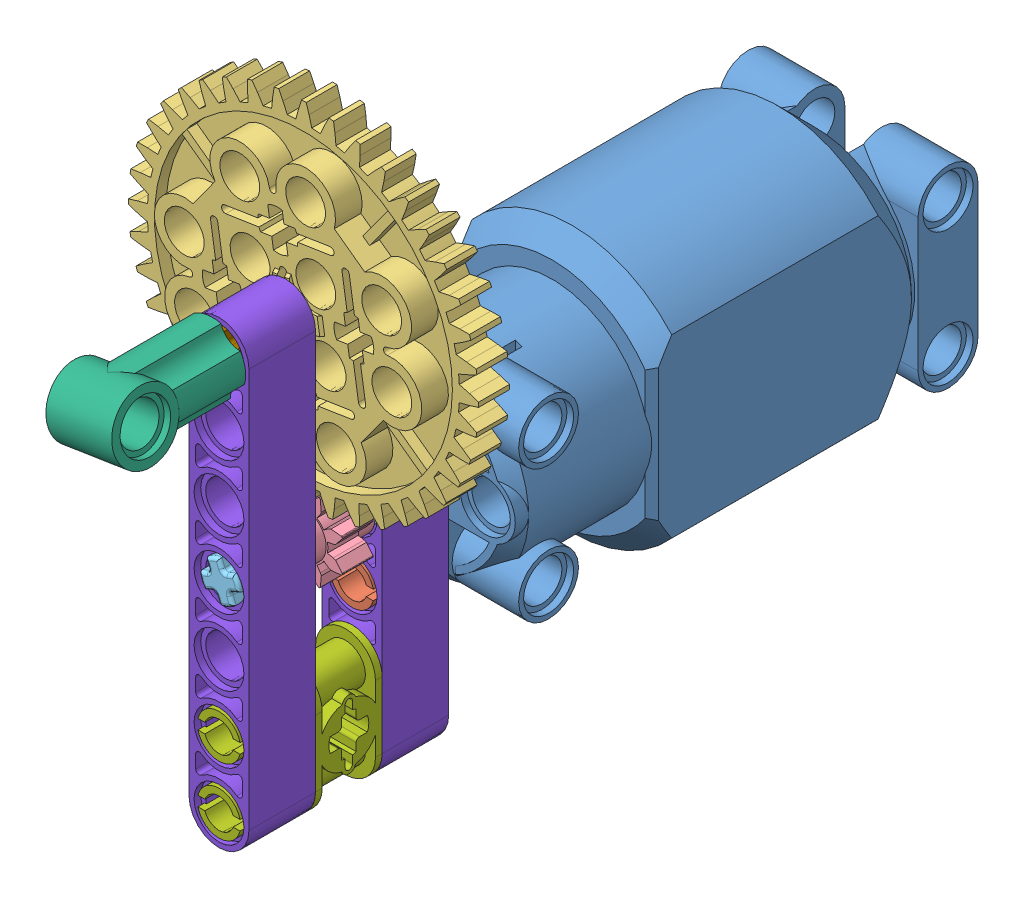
SolidWorks assembly 47.SLDASM, configuration 기본 (file format 9000). Lengths in mm.
Overall size (48.08 75.64 96).
12 component instances, 10 part files, 29 mates.
Components (placement in the parent):
- 99499 Motor 9V Power Functions L-1: 99499 Motor 9V Power Functions L.SLDPRT [기본] at (-6.2002 -1.7859 82.9324) size (24.01 32 55.46)
- 2780 Pin with Friction Ridges Lengthwise WITH Center Slots-1: 2780 Pin with Friction Ridges Lengthwise WITH Center Slots.SLDPRT [기본] at (-6.2002 -9.7859 82.9324) x (1 0 0) z (0 1 0) size (6 16 5.88)
- 3649 Gear 40 _-1: 3649 Gear 40 _.SLDPRT [기본] at (-6.2002 22.2141 94.9324) x (0.988069 0.154014 0) z (0.154014 -0.988069 0) size (42.1 8 42.1)
- 3647 Gear 8-1: 3647 Gear 8.SLDPRT [기본] at (-6.2002 -1.7859 94.9324) x (0.923719 0.383071 0) z (-0.383071 0.923719 0) size (10.06 8 10.06)
- 3705 Axle 4-1: 3705 Axle 4.SLDPRT [기본] at (-6.2002 -1.7859 106.9324) x (0.923719 0.383071 0) z (-0.383071 0.923719 0) size (4.8 32.01 4.8)
- 32013 Axle pin connector angled #1-1: 32013 Axle pin connector angled #1.SLDPRT [기본] at (-6.2002 22.2141 107.7324) x (0 0 -1) z (0.988069 0.154014 0) size (16 8 8)
- 32138 Pin Double with Axle Hole-1: 32138 Pin Double with Axle Hole.SLDPRT [기본] at (-6.2002 -21.7859 94.9324) x (0 -1 0) z (1 0 0) size (15.2 24 7.2)
- 32524 Beam 7-1: 32524 Beam 7.SLDPRT [기본] at (-6.2002 22.2141 106.9324) x (0 -1 0) z (1 0 0) size (55.2 8 7.2)
- 87083 Axle 4 w stop-1: 87083 Axle 4 w stop.SLDPRT [기본] at (-6.2002 22.2141 83.7324) x (0.988069 0.154014 0) z (0.154014 -0.988069 0) size (6 32.8 6)
- Motor 9V  PF Medium part-1: Motor 9V  PF Medium part.SLDPRT [기본] at (-4.1535 -1.523 74.9324) x (0.923719 0.383071 0) z (0 0 1) size (7 7 8)
- 32524 Beam 7-2: 32524 Beam 7.SLDPRT [기본] at (-6.2002 22.2141 90.9324) x (0 -1 0) z (1 0 0) size (55.2 8 7.2)
- 2780 Pin with Friction Ridges Lengthwise WITH Center Slots-2: 2780 Pin with Friction Ridges Lengthwise WITH Center Slots.SLDPRT [기본] at (-6.2002 6.2141 82.9324) x (1 0 0) z (0 1 0) size (6 16 5.88)
Mates (geometry in assembly coordinates):
- 동심1: concentric anti-aligned: cylinder of 99499 Motor 9V Power Functions L-1 through (-6.2002 -1.7859 74.9324) axis (0 0 1) radius 3.5; cylinder of Motor 9V  PF Medium part-1 through (-6.199 -1.7867 82.9324) axis (-0.000158 0.000092 -1) radius 3.5
- 일치1: coincident aligned: plane of 99499 Motor 9V Power Functions L-1 through (-6.2002 -1.7859 82.9324) normal (0 0 1); plane of Motor 9V  PF Medium part-1 through (-6.199 -1.7867 82.9324) normal (0.000158 -0.000092 1)
- 동심2: concentric anti-aligned: cylinder of 3705 Axle 4-1 through (-6.2 -1.7862 74.9325) axis (0.000097 -0.000054 1) radius 2.4; cylinder of Motor 9V  PF Medium part-1 through (-6.199 -1.7867 82.9324) axis (-0.000158 0.000092 -1) radius 2.4
- 일치2: coincident anti-aligned: plane of 3705 Axle 4-1 through (-8.1126 -3.236 74.9326) normal (0.269822 -0.96291 -0.000079); plane of Motor 9V  PF Medium part-1 through (-8.1114 -3.2367 82.9326) normal (-0.269924 0.962882 0.000131)
- 일치3: coincident aligned: plane of 3705 Axle 4-1 through (-6.2 -1.7862 74.9325) normal (-0.000097 0.000054 -1); circle of Motor 9V  PF Medium part-1
- 동심3: concentric anti-aligned: cylinder of 99499 Motor 9V Power Functions L-1 through (-6.2002 6.2141 74.9324) axis (0 0 1) radius 2.4; cylinder of 2780 Pin with Friction Ridges Lengthwise WITH Center Slots-2 through (-6.2002 6.2141 90.9324) axis (0 0 -1) radius 2.4
- 동심4: concentric anti-aligned: cylinder of 99499 Motor 9V Power Functions L-1 through (-6.2002 -9.7859 74.9324) axis (0 0 1) radius 2.4; cylinder of 2780 Pin with Friction Ridges Lengthwise WITH Center Slots-1 through (-6.2002 -9.7859 90.9324) axis (0 0 -1) radius 2.4
- 일치4: coincident anti-aligned: plane of 99499 Motor 9V Power Functions L-1 through (-6.2002 6.2141 82.1324) normal (0 0 1); plane of 2780 Pin with Friction Ridges Lengthwise WITH Center Slots-2 through (-6.2002 6.2141 82.1324) normal (0 0 -1)
- 일치5: coincident anti-aligned: plane of 99499 Motor 9V Power Functions L-1 through (-6.2002 -9.7859 82.1324) normal (0 0 1); plane of 2780 Pin with Friction Ridges Lengthwise WITH Center Slots-1 through (-6.2002 -9.7859 82.1324) normal (0 0 -1)
- 동심5: concentric anti-aligned: cylinder of 2780 Pin with Friction Ridges Lengthwise WITH Center Slots-1 through (-6.2002 -9.7859 90.9324) axis (0 0 -1) radius 2.4; cylinder of 32524 Beam 7-2 through (-6.2002 -9.7859 82.9324) axis (0 0 1) radius 2.4
- 동심6: concentric anti-aligned: cylinder of 32524 Beam 7-2 through (-6.2002 6.2141 82.9324) axis (0 0 1) radius 2.4; cylinder of 2780 Pin with Friction Ridges Lengthwise WITH Center Slots-2 through (-6.2002 6.2141 90.9324) axis (0 0 -1) radius 2.4
- 일치6: coincident anti-aligned: plane of 32524 Beam 7-2 through (-6.2002 6.2141 83.7324) normal (0 0 -1); plane of 2780 Pin with Friction Ridges Lengthwise WITH Center Slots-2 through (-6.2002 6.2141 83.7324) normal (0 0 1)
- 동심7: concentric anti-aligned: cylinder of 32138 Pin Double with Axle Hole-1 through (-6.2002 -25.7859 106.9324) axis (0 0 -1) radius 2.4; cylinder of 32524 Beam 7-2 through (-6.2002 -25.7859 82.9324) axis (0 0 1) radius 2.4
- 동심8: concentric anti-aligned: cylinder of 32138 Pin Double with Axle Hole-1 through (-6.2002 -17.7859 106.9324) axis (0 0 -1) radius 2.4; cylinder of 32524 Beam 7-2 through (-6.2002 -17.7859 82.9324) axis (0 0 1) radius 2.4
- 일치7: coincident anti-aligned: plane of 32138 Pin Double with Axle Hole-1 through (-6.2002 -25.7859 90.1324) normal (0 0 -1); plane of 32524 Beam 7-2 through (-6.2002 -25.7859 90.1324) normal (0 0 1)
- 동심9: concentric anti-aligned: cylinder of 3647 Gear 8-1 through (-6.1981 -1.7873 98.9324) axis (-0.000004 0.000017 -1) radius 2.4; cylinder of 3705 Axle 4-1 through (-6.2 -1.7862 74.9325) axis (0.000097 -0.000054 1) radius 2.4
- 일치9: coincident anti-aligned: plane of 3647 Gear 8-1 through (-5.203 -0.5945 98.9324) normal (0.269828 -0.962909 -0.000017); plane of 3705 Axle 4-1 through (-4.2874 -0.3363 74.9324) normal (-0.269822 0.96291 0.000079)
- 일치10: coincident anti-aligned: plane of 3647 Gear 8-1 through (-6.1981 -1.7871 90.9324) normal (-0.000004 0.000017 -1); plane of 32524 Beam 7-2 through (-6.2002 22.2141 90.9324) normal (0 0 1)
- 동심10: concentric aligned: cylinder of 87083 Axle 4 w stop-1 through (-6.1988 22.2128 82.9325) axis (0.000015 0.000068 1) radius 3; cylinder of 32524 Beam 7-2 through (-6.2002 22.2141 82.9324) axis (0 0 1) radius 2.4
- 일치11: coincident anti-aligned: plane of 87083 Axle 4 w stop-1 through (-6.1988 22.2128 83.7325) normal (0.000015 0.000068 1); plane of 32524 Beam 7-2 through (-6.2002 22.2141 83.7324) normal (0 0 -1)
- 동심11: concentric anti-aligned: cylinder of 3649 Gear 40 _-1 through (-6.1992 22.2152 90.9312) axis (0.000155 0.000151 1) radius 2.4; cylinder of 87083 Axle 4 w stop-1 through (-6.1983 22.215 115.7325) axis (-0.000015 -0.000068 -1) radius 2.4
- 일치12: coincident anti-aligned: plane of 3649 Gear 40 _-1 through (-5.0297 22.6408 90.931) normal (-0.422649 -0.906293 0.000203); plane of 87083 Axle 4 w stop-1 through (-5.0288 22.6406 115.7324) normal (0.42269 0.906274 -0.000068)
- 일치13: coincident anti-aligned: plane of 3649 Gear 40 _-1 through (-11.515 20.2806 90.9323) normal (-0.000155 -0.000151 -1); plane of 32524 Beam 7-2 through (-6.2002 22.2141 90.9324) normal (0 0 1)
- 동심12: concentric anti-aligned: cylinder of 32138 Pin Double with Axle Hole-1 through (-6.2002 -25.7859 106.9324) axis (0 0 -1) radius 2.4; cylinder of 32524 Beam 7-1 through (-6.2002 -25.7859 98.9324) axis (0 0 1) radius 2.4
- 동심13: concentric anti-aligned: cylinder of 32138 Pin Double with Axle Hole-1 through (-6.2002 -17.7859 106.9324) axis (0 0 -1) radius 2.4; cylinder of 32524 Beam 7-1 through (-6.2002 -17.7859 98.9324) axis (0 0 1) radius 2.4
- 일치14: coincident aligned: circle of 32138 Pin Double with Axle Hole-1; plane of 32524 Beam 7-1 through (-6.2002 -25.7859 99.7324) normal (0 0 -1)
- 동심14: concentric aligned: cylinder of 32013 Axle pin connector angled #1-1 through (-6.1934 22.2197 123.7363) axis (-0.000224 -0.000131 -1) radius 2.4; cylinder of 87083 Axle 4 w stop-1 through (-6.1983 22.215 115.7325) axis (-0.000015 -0.000068 -1) radius 2.4
- 일치15: coincident anti-aligned: plane of 32013 Axle pin connector angled #1-1 through (-3.7979 22.0734 123.7358) normal (-0.422723 -0.906259 0.000213); plane of 87083 Axle 4 w stop-1 through (-5.0288 22.6406 115.7324) normal (0.42269 0.906274 -0.000068)
- 탄젠트1: tangent anti-aligned: cylinder of 32013 Axle pin connector angled #1-1 through (-9.8193 23.9101 119.7359) axis (0.906259 -0.422723 -0.000147) radius 4; plane of 87083 Axle 4 w stop-1 through (-6.1983 22.215 115.7325) normal (0.000015 0.000068 1)
